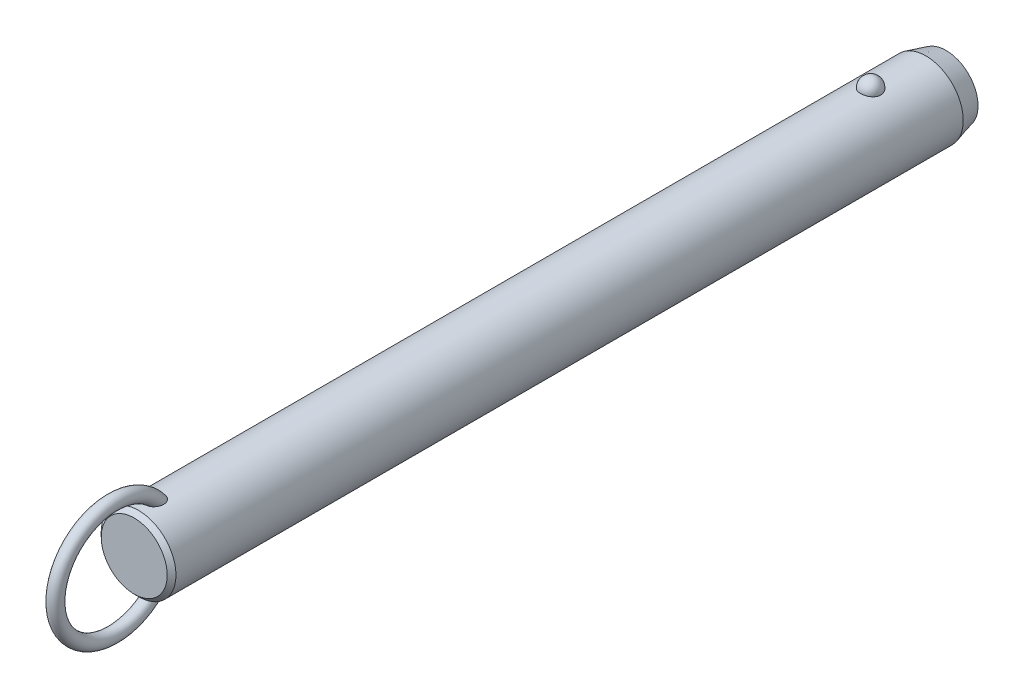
ISO-10303-21;
HEADER;
FILE_DESCRIPTION(('STEP AP214'),'2;1');
FILE_NAME('part.step','',(''),(''),'','','');
FILE_SCHEMA(('AUTOMOTIVE_DESIGN { 1 0 10303 214 1 1 1 1 }'));
ENDSEC;
DATA;
#1=APPLICATION_CONTEXT('core data for automotive mechanical design processes');
#2=APPLICATION_PROTOCOL_DEFINITION('international standard','automotive_design',2000,#1);
#3=PRODUCT_CONTEXT('',#1,'mechanical');
#4=PRODUCT('Part','Part','',(#3));
#5=PRODUCT_RELATED_PRODUCT_CATEGORY('part','',(#4));
#6=PRODUCT_DEFINITION_FORMATION('','',#4);
#7=PRODUCT_DEFINITION_CONTEXT('part definition',#1,'design');
#8=PRODUCT_DEFINITION('design','',#6,#7);
#9=PRODUCT_DEFINITION_SHAPE('','',#8);
#10=(LENGTH_UNIT() NAMED_UNIT(*) SI_UNIT(.MILLI.,.METRE.));
#11=(NAMED_UNIT(*) PLANE_ANGLE_UNIT() SI_UNIT($,.RADIAN.));
#12=(NAMED_UNIT(*) SI_UNIT($,.STERADIAN.) SOLID_ANGLE_UNIT());
#13=UNCERTAINTY_MEASURE_WITH_UNIT(LENGTH_MEASURE(1.E-05),#10,'distance_accuracy_value','');
#14=(GEOMETRIC_REPRESENTATION_CONTEXT(3) GLOBAL_UNCERTAINTY_ASSIGNED_CONTEXT((#13)) GLOBAL_UNIT_ASSIGNED_CONTEXT((#10,
#11,#12)) REPRESENTATION_CONTEXT('',''));
#15=CARTESIAN_POINT('',(0.,0.,0.));
#16=DIRECTION('',(0.,0.,1.));
#17=DIRECTION('',(1.,0.,0.));
#18=AXIS2_PLACEMENT_3D('',#15,#16,#17);
#19=CARTESIAN_POINT('',(0.,0.,203.));
#20=DIRECTION('',(0.,0.,-1.));
#21=DIRECTION('',(-1.,0.,0.));
#22=AXIS2_PLACEMENT_3D('',#19,#20,#21);
#23=CYLINDRICAL_SURFACE('',#22,11.1);
#24=CARTESIAN_POINT('',(2.9724815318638,10.6945945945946,-3.00000000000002));
#25=CARTESIAN_POINT('',(2.9724783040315,10.6945972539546,-2.8322505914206));
#26=CARTESIAN_POINT('',(2.95876598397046,10.6984356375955,-2.66445972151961));
#27=CARTESIAN_POINT('',(2.90424529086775,10.7133624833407,-2.3336238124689));
#28=CARTESIAN_POINT('',(2.8634252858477,10.7244540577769,-2.17058084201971));
#29=CARTESIAN_POINT('',(2.75573657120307,10.7526272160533,-1.85396767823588));
#30=CARTESIAN_POINT('',(2.68887937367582,10.7697061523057,-1.70039333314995));
#31=CARTESIAN_POINT('',(2.53079696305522,10.8079438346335,-1.40691598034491));
#32=CARTESIAN_POINT('',(2.43957264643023,10.8291024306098,-1.26701246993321));
#33=CARTESIAN_POINT('',(2.23458150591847,10.8732541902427,-1.00409565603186));
#34=CARTESIAN_POINT('',(2.12071295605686,10.8962553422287,-0.881162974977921));
#35=CARTESIAN_POINT('',(1.87365402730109,10.9414421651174,-0.656352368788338));
#36=CARTESIAN_POINT('',(1.74046358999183,10.9636278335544,-0.554474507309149));
#37=CARTESIAN_POINT('',(1.45872188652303,11.0046495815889,-0.374872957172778));
#38=CARTESIAN_POINT('',(1.31021276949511,11.0234944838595,-0.297085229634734));
#39=CARTESIAN_POINT('',(1.00170030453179,11.0557957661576,-0.167529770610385));
#40=CARTESIAN_POINT('',(0.841698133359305,11.0692526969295,-0.115759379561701));
#41=CARTESIAN_POINT('',(0.51760779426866,11.0890932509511,-0.040392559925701));
#42=CARTESIAN_POINT('',(0.353633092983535,11.0955916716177,-0.0163383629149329));
#43=CARTESIAN_POINT('',(0.0238420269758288,11.1011989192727,0.00445177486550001));
#44=CARTESIAN_POINT('',(-0.141974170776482,11.1003084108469,0.00119017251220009));
#45=CARTESIAN_POINT('',(-0.468405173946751,11.0912990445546,-0.0323233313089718));
#46=CARTESIAN_POINT('',(-0.629059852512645,11.0832767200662,-0.0622147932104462));
#47=CARTESIAN_POINT('',(-0.942937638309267,11.0609962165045,-0.147645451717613));
#48=CARTESIAN_POINT('',(-1.09616062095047,11.0467379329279,-0.20318507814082));
#49=CARTESIAN_POINT('',(-1.39181061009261,11.0134071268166,-0.338752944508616));
#50=CARTESIAN_POINT('',(-1.53417383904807,10.9943086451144,-0.418913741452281));
#51=CARTESIAN_POINT('',(-1.80342160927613,10.9533667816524,-0.601448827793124));
#52=CARTESIAN_POINT('',(-1.9303046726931,10.9315231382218,-0.703825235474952));
#53=CARTESIAN_POINT('',(-2.16747598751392,10.887005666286,-0.930091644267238));
#54=CARTESIAN_POINT('',(-2.27742774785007,10.8643239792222,-1.05433291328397));
#55=CARTESIAN_POINT('',(-2.47517316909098,10.8209886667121,-1.31966633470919));
#56=CARTESIAN_POINT('',(-2.56296538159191,10.8003351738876,-1.46075958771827));
#57=CARTESIAN_POINT('',(-2.71500300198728,10.7631304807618,-1.75753646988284));
#58=CARTESIAN_POINT('',(-2.77898901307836,10.7466250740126,-1.91335887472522));
#59=CARTESIAN_POINT('',(-2.88046189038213,10.7198747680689,-2.23391529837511));
#60=CARTESIAN_POINT('',(-2.91794947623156,10.709629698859,-2.3986490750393));
#61=CARTESIAN_POINT('',(-2.96537819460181,10.6965949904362,-2.73165170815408));
#62=CARTESIAN_POINT('',(-2.97542891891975,10.693775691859,-2.89990378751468));
#63=CARTESIAN_POINT('',(-2.96804271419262,10.6958279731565,-3.23575286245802));
#64=CARTESIAN_POINT('',(-2.95060646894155,10.7006993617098,-3.4033498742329));
#65=CARTESIAN_POINT('',(-2.88883358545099,10.71753912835,-3.73233906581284));
#66=CARTESIAN_POINT('',(-2.84462026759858,10.7294749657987,-3.89375610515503));
#67=CARTESIAN_POINT('',(-2.73050447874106,10.7590797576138,-4.20667949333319));
#68=CARTESIAN_POINT('',(-2.66060103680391,10.7767489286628,-4.35818546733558));
#69=CARTESIAN_POINT('',(-2.49642559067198,10.8159599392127,-4.64785421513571));
#70=CARTESIAN_POINT('',(-2.40203047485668,10.8375211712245,-4.78594458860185));
#71=CARTESIAN_POINT('',(-2.19143488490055,10.8820570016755,-5.04410382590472));
#72=CARTESIAN_POINT('',(-2.07523364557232,10.9050316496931,-5.16417205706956));
#73=CARTESIAN_POINT('',(-1.82361254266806,10.9499219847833,-5.38334833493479));
#74=CARTESIAN_POINT('',(-1.68812945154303,10.9718338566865,-5.48238464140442));
#75=CARTESIAN_POINT('',(-1.40191298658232,11.0120611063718,-5.6561887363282));
#76=CARTESIAN_POINT('',(-1.25118062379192,11.0303767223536,-5.73095813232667));
#77=CARTESIAN_POINT('',(-0.940570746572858,11.0611653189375,-5.85334725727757));
#78=CARTESIAN_POINT('',(-0.780821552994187,11.0737044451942,-5.90127578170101));
#79=CARTESIAN_POINT('',(-0.455204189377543,11.0918598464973,-5.9699297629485));
#80=CARTESIAN_POINT('',(-0.289336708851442,11.0974768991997,-5.99065827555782));
#81=CARTESIAN_POINT('',(0.0406846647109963,11.1011307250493,-6.00418773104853));
#82=CARTESIAN_POINT('',(0.204817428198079,11.099299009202,-5.99747318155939));
#83=CARTESIAN_POINT('',(0.529553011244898,11.088551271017,-5.95740317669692));
#84=CARTESIAN_POINT('',(0.690155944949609,11.0796354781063,-5.92404858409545));
#85=CARTESIAN_POINT('',(1.0027760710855,11.0557204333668,-5.83180084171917));
#86=CARTESIAN_POINT('',(1.15482001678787,11.0407414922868,-5.7729929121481));
#87=CARTESIAN_POINT('',(1.44678373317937,11.0062913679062,-5.63147366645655));
#88=CARTESIAN_POINT('',(1.58670279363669,10.9868199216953,-5.54876095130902));
#89=CARTESIAN_POINT('',(1.8527023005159,10.9451315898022,-5.36027644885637));
#90=CARTESIAN_POINT('',(1.97855158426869,10.9228788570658,-5.25418644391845));
#91=CARTESIAN_POINT('',(2.21080872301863,10.8782509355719,-5.02251354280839));
#92=CARTESIAN_POINT('',(2.31721312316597,10.8558757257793,-4.89692718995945));
#93=CARTESIAN_POINT('',(2.5094551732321,10.8130715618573,-4.62745408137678));
#94=CARTESIAN_POINT('',(2.59493284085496,10.7926798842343,-4.48330448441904));
#95=CARTESIAN_POINT('',(2.740862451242,10.7565495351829,-4.18236358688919));
#96=CARTESIAN_POINT('',(2.80132490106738,10.7408089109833,-4.02557762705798));
#97=CARTESIAN_POINT('',(2.88959070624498,10.7173718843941,-3.72475308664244));
#98=CARTESIAN_POINT('',(2.92062102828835,10.7088950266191,-3.58171216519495));
#99=CARTESIAN_POINT('',(2.96206765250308,10.6975052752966,-3.29245795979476));
#100=CARTESIAN_POINT('',(2.97248434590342,10.6945922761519,-3.14624473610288));
#101=CARTESIAN_POINT('',(2.9724815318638,10.6945945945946,-3.00000000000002));
#102=B_SPLINE_CURVE_WITH_KNOTS('',3,(#24,#25,#26,#27,#28,#29,#30,#31,#32,#33,#34,#35,#36,#37,
#38,#39,#40,#41,#42,#43,#44,#45,#46,#47,#48,#49,#50,#51,#52,#53,#54,#55,#56,#57,#58,#59,#60,#61,
#62,#63,#64,#65,#66,#67,#68,#69,#70,#71,#72,#73,#74,#75,#76,#77,#78,#79,#80,#81,#82,#83,#84,#85,
#86,#87,#88,#89,#90,#91,#92,#93,#94,#95,#96,#97,#98,#99,#100,#101),.UNSPECIFIED.,.T.,.F.,(4,2,2,
2,2,2,2,2,2,2,2,2,2,2,2,2,2,2,2,2,2,2,2,2,2,2,2,2,2,2,2,2,2,2,2,2,2,2,4),(0.,0.502722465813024,
1.00566079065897,1.5083769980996,2.01107471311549,2.51608392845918,3.02109467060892,
3.52475118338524,4.02835620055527,4.523518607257,5.0186364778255,5.50715297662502,
5.99567766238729,6.48688002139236,6.97812923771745,7.47814366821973,7.97819077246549,
8.48353712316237,8.98886974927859,9.49218093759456,9.99547960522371,10.4964777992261,
10.997494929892,11.5010810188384,12.0046847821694,12.5099796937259,13.0152411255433,
13.5145635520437,14.0138298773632,14.5043200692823,14.9947943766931,15.4836390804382,
15.9725123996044,16.4685040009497,16.9645836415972,17.4686765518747,17.972557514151,
18.410841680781,18.849117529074),.UNSPECIFIED.);
#103=CARTESIAN_POINT('',(2.9724815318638,10.6945945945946,-3.00000000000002));
#104=VERTEX_POINT('',#103);
#105=EDGE_CURVE('E41',#104,#104,#102,.T.);
#106=ORIENTED_EDGE('',*,*,#105,.T.);
#107=EDGE_LOOP('',(#106));
#108=FACE_BOUND('',#107,.T.);
#109=CARTESIAN_POINT('',(0.,0.,214.4));
#110=DIRECTION('',(0.,0.,1.));
#111=DIRECTION('',(1.,0.,0.));
#112=AXIS2_PLACEMENT_3D('',#109,#110,#111);
#113=CIRCLE('',#112,11.1);
#114=CARTESIAN_POINT('',(11.1,0.,214.4));
#115=VERTEX_POINT('',#114);
#116=EDGE_CURVE('E10',#115,#115,#113,.F.);
#117=ORIENTED_EDGE('',*,*,#116,.T.);
#118=EDGE_LOOP('',(#117));
#119=FACE_BOUND('',#118,.T.);
#120=CARTESIAN_POINT('',(-0.564520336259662,-11.0856356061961,206.657815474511));
#121=CARTESIAN_POINT('',(-0.667202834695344,-11.0804062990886,206.691283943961));
#122=CARTESIAN_POINT('',(-0.766875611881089,-11.0738877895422,206.733835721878));
#123=CARTESIAN_POINT('',(-0.957284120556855,-11.0590576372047,206.835419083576));
#124=CARTESIAN_POINT('',(-1.04801616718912,-11.0507452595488,206.89445742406));
#125=CARTESIAN_POINT('',(-1.21800952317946,-11.0333016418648,207.026529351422));
#126=CARTESIAN_POINT('',(-1.29730805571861,-11.0241732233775,207.099515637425));
#127=CARTESIAN_POINT('',(-1.44337665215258,-11.0060026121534,207.257037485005));
#128=CARTESIAN_POINT('',(-1.51014622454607,-10.9969604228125,207.341573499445));
#129=CARTESIAN_POINT('',(-1.63454620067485,-10.9791841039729,207.525521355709));
#130=CARTESIAN_POINT('',(-1.69127003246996,-10.9705107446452,207.625549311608));
#131=CARTESIAN_POINT('',(-1.78980785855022,-10.9548648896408,207.832790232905));
#132=CARTESIAN_POINT('',(-1.83161214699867,-10.9478935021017,207.940007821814));
#133=CARTESIAN_POINT('',(-1.91557028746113,-10.9335803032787,208.205408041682));
#134=CARTESIAN_POINT('',(-1.95040620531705,-10.9273269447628,208.365980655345));
#135=CARTESIAN_POINT('',(-1.99388326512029,-10.9194709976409,208.690697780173));
#136=CARTESIAN_POINT('',(-2.00248051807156,-10.9178762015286,208.854847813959));
#137=CARTESIAN_POINT('',(-1.99551615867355,-10.9191578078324,209.224650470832));
#138=CARTESIAN_POINT('',(-1.97322066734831,-10.9232807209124,209.430191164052));
#139=CARTESIAN_POINT('',(-1.91529761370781,-10.9335244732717,209.733595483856));
#140=CARTESIAN_POINT('',(-1.8918457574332,-10.9376266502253,209.834088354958));
#141=CARTESIAN_POINT('',(-1.83700674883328,-10.9469720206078,210.032855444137));
#142=CARTESIAN_POINT('',(-1.80562070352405,-10.9522150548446,210.131129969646));
#143=CARTESIAN_POINT('',(-1.73463055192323,-10.9636837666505,210.325914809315));
#144=CARTESIAN_POINT('',(-1.69493416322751,-10.9699202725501,210.422390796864));
#145=CARTESIAN_POINT('',(-1.6074514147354,-10.9830806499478,210.611626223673));
#146=CARTESIAN_POINT('',(-1.55966150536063,-10.9900048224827,210.704384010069));
#147=CARTESIAN_POINT('',(-1.45591812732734,-11.0042280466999,210.884690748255));
#148=CARTESIAN_POINT('',(-1.40000013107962,-11.0115253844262,210.972260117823));
#149=CARTESIAN_POINT('',(-1.27937470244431,-11.0261911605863,211.141029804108));
#150=CARTESIAN_POINT('',(-1.21467835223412,-11.0335594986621,211.22223795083));
#151=CARTESIAN_POINT('',(-1.08218150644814,-11.0473027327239,211.369001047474));
#152=CARTESIAN_POINT('',(-1.01522633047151,-11.0537063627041,211.435309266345));
#153=CARTESIAN_POINT('',(-0.872952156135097,-11.065850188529,211.558378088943));
#154=CARTESIAN_POINT('',(-0.797642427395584,-11.0715911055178,211.615149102));
#155=CARTESIAN_POINT('',(-0.65139686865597,-11.081071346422,211.707515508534));
#156=CARTESIAN_POINT('',(-0.581712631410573,-11.0849841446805,211.745049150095));
#157=CARTESIAN_POINT('',(-0.437066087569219,-11.0916271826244,211.808259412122));
#158=CARTESIAN_POINT('',(-0.362109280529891,-11.0943586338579,211.833948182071));
#159=CARTESIAN_POINT('',(-0.207828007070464,-11.0983242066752,211.871117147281));
#160=CARTESIAN_POINT('',(-0.128467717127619,-11.0995432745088,211.882454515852));
#161=CARTESIAN_POINT('',(0.0309101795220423,-11.1002423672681,211.888965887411));
#162=CARTESIAN_POINT('',(0.110927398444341,-11.0997233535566,211.884148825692));
#163=CARTESIAN_POINT('',(0.256406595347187,-11.097240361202,211.860959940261));
#164=CARTESIAN_POINT('',(0.322235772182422,-11.0955074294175,211.844754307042));
#165=CARTESIAN_POINT('',(0.450635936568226,-11.0910350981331,211.802600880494));
#166=CARTESIAN_POINT('',(0.513205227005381,-11.0882951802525,211.776648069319));
#167=CARTESIAN_POINT('',(0.662626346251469,-11.0805620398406,211.702607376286));
#168=CARTESIAN_POINT('',(0.747127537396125,-11.0751144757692,211.649845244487));
#169=CARTESIAN_POINT('',(0.906756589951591,-11.0631932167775,211.531720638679));
#170=CARTESIAN_POINT('',(0.981859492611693,-11.0567168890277,211.466325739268));
#171=CARTESIAN_POINT('',(1.10712207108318,-11.0447856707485,211.34226337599));
#172=CARTESIAN_POINT('',(1.15909566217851,-11.0394280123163,211.285383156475));
#173=CARTESIAN_POINT('',(1.25791923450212,-11.0286040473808,211.167327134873));
#174=CARTESIAN_POINT('',(1.3047664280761,-11.0231376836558,211.106149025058));
#175=CARTESIAN_POINT('',(1.43818612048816,-11.0068027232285,210.917305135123));
#176=CARTESIAN_POINT('',(1.5175176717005,-10.9960104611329,210.784453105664));
#177=CARTESIAN_POINT('',(1.63597546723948,-10.9788847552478,210.553137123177));
#178=CARTESIAN_POINT('',(1.67988876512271,-10.9722190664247,210.457053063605));
#179=CARTESIAN_POINT('',(1.75953241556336,-10.9597298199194,210.261431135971));
#180=CARTESIAN_POINT('',(1.79525967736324,-10.9539065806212,210.161891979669));
#181=CARTESIAN_POINT('',(1.85844731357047,-10.9433632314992,209.96021118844));
#182=CARTESIAN_POINT('',(1.88591073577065,-10.9386427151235,209.858070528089));
#183=CARTESIAN_POINT('',(1.93234324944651,-10.9305350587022,209.651819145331));
#184=CARTESIAN_POINT('',(1.95131065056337,-10.9271481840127,209.547708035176));
#185=CARTESIAN_POINT('',(1.99040203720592,-10.9201183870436,209.265458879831));
#186=CARTESIAN_POINT('',(2.00221217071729,-10.9179256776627,209.086037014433));
#187=CARTESIAN_POINT('',(1.99711676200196,-10.9188636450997,208.727713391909));
#188=CARTESIAN_POINT('',(1.98026150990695,-10.9219849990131,208.548811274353));
#189=CARTESIAN_POINT('',(1.92151657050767,-10.9324473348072,208.23645144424));
#190=CARTESIAN_POINT('',(1.88605081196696,-10.9386915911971,208.101759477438));
#191=CARTESIAN_POINT('',(1.7939302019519,-10.9541780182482,207.839966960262));
#192=CARTESIAN_POINT('',(1.73729868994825,-10.9634168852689,207.712858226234));
#193=CARTESIAN_POINT('',(1.61237037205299,-10.9824218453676,207.489418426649));
#194=CARTESIAN_POINT('',(1.54715374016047,-10.9918945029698,207.391345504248));
#195=CARTESIAN_POINT('',(1.40127026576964,-11.0114415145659,207.207434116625));
#196=CARTESIAN_POINT('',(1.32060742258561,-11.0215157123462,207.121592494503));
#197=CARTESIAN_POINT('',(1.14474787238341,-11.041168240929,206.965163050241));
#198=CARTESIAN_POINT('',(1.04947805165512,-11.0507437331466,206.894656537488));
#199=CARTESIAN_POINT('',(0.847278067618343,-11.0680789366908,206.772640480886));
#200=CARTESIAN_POINT('',(0.740351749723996,-11.0758392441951,206.721124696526));
#201=CARTESIAN_POINT('',(0.529289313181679,-11.0878275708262,206.643485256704));
#202=CARTESIAN_POINT('',(0.425895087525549,-11.0923259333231,206.615377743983));
#203=CARTESIAN_POINT('',(0.215723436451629,-11.0984001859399,206.577703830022));
#204=CARTESIAN_POINT('',(0.108947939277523,-11.0999777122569,206.568127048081));
#205=CARTESIAN_POINT('',(-0.0938962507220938,-11.1000196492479,206.567877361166));
#206=CARTESIAN_POINT('',(-0.189967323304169,-11.0987797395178,206.575408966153));
#207=CARTESIAN_POINT('',(-0.379657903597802,-11.0939111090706,206.605507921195));
#208=CARTESIAN_POINT('',(-0.473277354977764,-11.0902823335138,206.628075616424));
#209=CARTESIAN_POINT('',(-0.564520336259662,-11.0856356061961,206.657815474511));
#210=B_SPLINE_CURVE_WITH_KNOTS('',3,(#120,#121,#122,#123,#124,#125,#126,#127,#128,#129,#130,
#131,#132,#133,#134,#135,#136,#137,#138,#139,#140,#141,#142,#143,#144,#145,#146,#147,#148,#149,
#150,#151,#152,#153,#154,#155,#156,#157,#158,#159,#160,#161,#162,#163,#164,#165,#166,#167,#168,
#169,#170,#171,#172,#173,#174,#175,#176,#177,#178,#179,#180,#181,#182,#183,#184,#185,#186,#187,
#188,#189,#190,#191,#192,#193,#194,#195,#196,#197,#198,#199,#200,#201,#202,#203,#204,#205,#206,
#207,#208,#209),.UNSPECIFIED.,.T.,.F.,(4,2,2,2,2,2,2,2,2,2,2,2,2,2,2,2,2,2,2,2,2,2,2,2,2,2,2,2,
2,2,2,2,2,2,2,2,2,2,2,2,2,2,2,2,4),(0.,0.323999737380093,0.648132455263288,0.971184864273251,
1.29424994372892,1.63886237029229,1.98369857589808,2.47426059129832,2.96564271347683,
3.58257396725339,3.89215258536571,4.201688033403,4.5148627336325,4.82817514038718,
5.14015911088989,5.45175282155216,5.73442856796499,6.01679375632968,6.25364580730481,
6.49025437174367,6.72919963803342,6.96801276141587,7.17061258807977,7.37331685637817,
7.67094989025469,7.96935728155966,8.20075067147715,8.43226927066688,8.89581623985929,
9.2130653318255,9.53043400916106,9.84768549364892,10.1650000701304,10.70229304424,
11.2386443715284,11.6553390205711,12.0715755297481,12.4245637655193,12.7774607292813,
13.1321855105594,13.4867936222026,13.8068771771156,14.1267813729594,14.4146787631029,
14.7025827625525),.UNSPECIFIED.);
#211=CARTESIAN_POINT('',(-0.564520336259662,-11.0856356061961,206.657815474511));
#212=VERTEX_POINT('',#211);
#213=EDGE_CURVE('E59',#212,#212,#210,.T.);
#214=ORIENTED_EDGE('',*,*,#213,.T.);
#215=EDGE_LOOP('',(#214));
#216=FACE_BOUND('',#215,.T.);
#217=CARTESIAN_POINT('',(-0.564520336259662,11.0856356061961,206.657815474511));
#218=CARTESIAN_POINT('',(-0.46854206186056,11.0905203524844,206.626545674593));
#219=CARTESIAN_POINT('',(-0.369793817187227,11.0942886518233,206.603157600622));
#220=CARTESIAN_POINT('',(-0.169555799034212,11.0991586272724,206.573085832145));
#221=CARTESIAN_POINT('',(-0.0680604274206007,11.1002543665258,206.56643932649));
#222=CARTESIAN_POINT('',(0.134549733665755,11.099646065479,206.570157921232));
#223=CARTESIAN_POINT('',(0.235664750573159,11.0979441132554,206.58051033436));
#224=CARTESIAN_POINT('',(0.434632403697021,11.0919342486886,206.617831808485));
#225=CARTESIAN_POINT('',(0.53248665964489,11.0876276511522,206.644792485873));
#226=CARTESIAN_POINT('',(0.722445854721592,11.0768742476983,206.7144096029));
#227=CARTESIAN_POINT('',(0.814543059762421,11.0704246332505,206.757086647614));
#228=CARTESIAN_POINT('',(0.990565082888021,11.0560659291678,206.856648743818));
#229=CARTESIAN_POINT('',(1.07448844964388,11.048156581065,206.913536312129));
#230=CARTESIAN_POINT('',(1.23562672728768,11.0313221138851,207.042210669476));
#231=CARTESIAN_POINT('',(1.31242684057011,11.0223686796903,207.114511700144));
#232=CARTESIAN_POINT('',(1.45398030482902,11.0045918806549,207.270042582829));
#233=CARTESIAN_POINT('',(1.51873073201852,10.9957685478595,207.353275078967));
#234=CARTESIAN_POINT('',(1.64107232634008,10.9782087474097,207.536384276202));
#235=CARTESIAN_POINT('',(1.6974317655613,10.9695572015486,207.637089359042));
#236=CARTESIAN_POINT('',(1.79515063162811,10.9539887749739,207.845626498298));
#237=CARTESIAN_POINT('',(1.83649966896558,10.9470730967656,207.95346343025));
#238=CARTESIAN_POINT('',(1.91931148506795,10.9329211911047,208.220399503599));
#239=CARTESIAN_POINT('',(1.95340104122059,10.9267904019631,208.381861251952));
#240=CARTESIAN_POINT('',(1.99526195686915,10.9192174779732,208.70821631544));
#241=CARTESIAN_POINT('',(2.00298989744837,10.9177830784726,208.87311484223));
#242=CARTESIAN_POINT('',(1.99396251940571,10.9194420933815,209.244100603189));
#243=CARTESIAN_POINT('',(1.97050829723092,10.923774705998,209.45003871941));
#244=CARTESIAN_POINT('',(1.91079643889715,10.9343131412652,209.753901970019));
#245=CARTESIAN_POINT('',(1.88673702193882,10.9385106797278,209.854529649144));
#246=CARTESIAN_POINT('',(1.8306550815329,10.9480376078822,210.053510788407));
#247=CARTESIAN_POINT('',(1.79863369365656,10.9533668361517,210.151864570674));
#248=CARTESIAN_POINT('',(1.72633365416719,10.9649954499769,210.346720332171));
#249=CARTESIAN_POINT('',(1.68596409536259,10.9713053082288,210.44318790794));
#250=CARTESIAN_POINT('',(1.59707998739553,10.9845964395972,210.632323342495));
#251=CARTESIAN_POINT('',(1.54856169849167,10.9915780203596,210.724989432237));
#252=CARTESIAN_POINT('',(1.44330168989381,11.0058935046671,210.904975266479));
#253=CARTESIAN_POINT('',(1.3865974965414,11.0132257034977,210.992316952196));
#254=CARTESIAN_POINT('',(1.2643115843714,11.0279330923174,211.160456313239));
#255=CARTESIAN_POINT('',(1.19874160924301,11.0353082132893,211.241262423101));
#256=CARTESIAN_POINT('',(1.06542088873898,11.048931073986,211.385985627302));
#257=CARTESIAN_POINT('',(0.998640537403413,11.0552153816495,211.450784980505));
#258=CARTESIAN_POINT('',(0.856896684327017,11.0671032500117,211.570846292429));
#259=CARTESIAN_POINT('',(0.781942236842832,11.0727075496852,211.626118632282));
#260=CARTESIAN_POINT('',(0.636276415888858,11.081949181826,211.715972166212));
#261=CARTESIAN_POINT('',(0.566755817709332,11.0857572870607,211.752441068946));
#262=CARTESIAN_POINT('',(0.422602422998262,11.0921860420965,211.813533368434));
#263=CARTESIAN_POINT('',(0.347974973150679,11.0948079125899,211.838168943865));
#264=CARTESIAN_POINT('',(0.194593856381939,11.0985608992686,211.873323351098));
#265=CARTESIAN_POINT('',(0.115807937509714,11.0996777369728,211.883706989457));
#266=CARTESIAN_POINT('',(-0.042249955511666,11.1002003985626,211.888574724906));
#267=CARTESIAN_POINT('',(-0.121521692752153,11.09960699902,211.883066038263));
#268=CARTESIAN_POINT('',(-0.266046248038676,11.0970123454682,211.858827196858));
#269=CARTESIAN_POINT('',(-0.331661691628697,11.0952283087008,211.842135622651));
#270=CARTESIAN_POINT('',(-0.459588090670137,11.0906663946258,211.799111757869));
#271=CARTESIAN_POINT('',(-0.521897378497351,11.0878880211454,211.772774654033));
#272=CARTESIAN_POINT('',(-0.671446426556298,11.0800342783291,211.697513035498));
#273=CARTESIAN_POINT('',(-0.756250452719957,11.0744969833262,211.643818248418));
#274=CARTESIAN_POINT('',(-0.91634957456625,11.0624045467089,211.523802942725));
#275=CARTESIAN_POINT('',(-0.991618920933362,11.0558467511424,211.457449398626));
#276=CARTESIAN_POINT('',(-1.11713140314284,11.0437783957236,211.331633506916));
#277=CARTESIAN_POINT('',(-1.16920539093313,11.0383619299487,211.273952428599));
#278=CARTESIAN_POINT('',(-1.26817476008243,11.02743010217,211.154280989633));
#279=CARTESIAN_POINT('',(-1.315067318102,11.0219146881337,211.092288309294));
#280=CARTESIAN_POINT('',(-1.40399813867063,11.0109399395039,210.964784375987));
#281=CARTESIAN_POINT('',(-1.44602864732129,11.0054807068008,210.899267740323));
#282=CARTESIAN_POINT('',(-1.52538779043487,10.9947621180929,210.765422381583));
#283=CARTESIAN_POINT('',(-1.56271516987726,10.9895028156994,210.697092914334));
#284=CARTESIAN_POINT('',(-1.64537943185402,10.9774790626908,210.533210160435));
#285=CARTESIAN_POINT('',(-1.68879497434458,10.9708503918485,210.4366735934));
#286=CARTESIAN_POINT('',(-1.76740738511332,10.9584602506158,210.240236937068));
#287=CARTESIAN_POINT('',(-1.80260120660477,10.95269910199,210.14033561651));
#288=CARTESIAN_POINT('',(-1.86468657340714,10.9423003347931,209.937966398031));
#289=CARTESIAN_POINT('',(-1.89158164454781,10.9376622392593,209.835499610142));
#290=CARTESIAN_POINT('',(-1.93682458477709,10.9297405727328,209.628642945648));
#291=CARTESIAN_POINT('',(-1.95517082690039,10.9264572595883,209.524252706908));
#292=CARTESIAN_POINT('',(-1.99232562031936,10.9197647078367,209.24262876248));
#293=CARTESIAN_POINT('',(-2.00294603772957,10.9177914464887,209.064185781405));
#294=CARTESIAN_POINT('',(-1.99566675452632,10.9191290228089,208.707996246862));
#295=CARTESIAN_POINT('',(-1.97781651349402,10.9224306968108,208.53024902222));
#296=CARTESIAN_POINT('',(-1.91747214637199,10.9331592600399,208.219792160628));
#297=CARTESIAN_POINT('',(-1.88131022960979,10.9395108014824,208.085825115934));
#298=CARTESIAN_POINT('',(-1.78790380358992,10.9551659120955,207.82559757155));
#299=CARTESIAN_POINT('',(-1.73068309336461,10.9644661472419,207.699328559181));
#300=CARTESIAN_POINT('',(-1.60475573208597,10.9835398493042,207.47741565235));
#301=CARTESIAN_POINT('',(-1.53908879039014,10.9930297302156,207.380026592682));
#302=CARTESIAN_POINT('',(-1.39238608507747,11.0125708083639,207.197525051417));
#303=CARTESIAN_POINT('',(-1.31135150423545,11.0226219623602,207.112411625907));
#304=CARTESIAN_POINT('',(-1.14382035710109,11.0411991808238,206.96529943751));
#305=CARTESIAN_POINT('',(-1.0585850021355,11.0497792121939,206.90186930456));
#306=CARTESIAN_POINT('',(-0.878723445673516,11.0655285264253,206.790250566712));
#307=CARTESIAN_POINT('',(-0.784123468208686,11.0727015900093,206.742020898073));
#308=CARTESIAN_POINT('',(-0.646163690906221,11.0812501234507,206.686023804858));
#309=CARTESIAN_POINT('',(-0.605595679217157,11.0835451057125,206.671197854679));
#310=CARTESIAN_POINT('',(-0.564520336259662,11.0856356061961,206.657815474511));
#311=B_SPLINE_CURVE_WITH_KNOTS('',3,(#217,#218,#219,#220,#221,#222,#223,#224,#225,#226,#227,
#228,#229,#230,#231,#232,#233,#234,#235,#236,#237,#238,#239,#240,#241,#242,#243,#244,#245,#246,
#247,#248,#249,#250,#251,#252,#253,#254,#255,#256,#257,#258,#259,#260,#261,#262,#263,#264,#265,
#266,#267,#268,#269,#270,#271,#272,#273,#274,#275,#276,#277,#278,#279,#280,#281,#282,#283,#284,
#285,#286,#287,#288,#289,#290,#291,#292,#293,#294,#295,#296,#297,#298,#299,#300,#301,#302,#303,
#304,#305,#306,#307,#308,#309,#310),.UNSPECIFIED.,.T.,.F.,(4,2,2,2,2,2,2,2,2,2,2,2,2,2,2,2,2,2,
2,2,2,2,2,2,2,2,2,2,2,2,2,2,2,2,2,2,2,2,2,2,2,2,2,2,2,2,4),(0.,0.303061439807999,
0.606795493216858,0.910302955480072,1.21365733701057,1.51741085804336,1.82121821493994,
2.13745205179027,2.45376252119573,2.799586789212,3.14564996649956,3.63832391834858,
4.13180893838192,4.75031912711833,5.06071926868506,5.37107516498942,5.6850077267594,
5.99908475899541,6.31176519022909,6.62403542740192,6.90315673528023,7.18197194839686,
7.41687778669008,7.65154134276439,7.88841587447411,8.12518286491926,8.32752842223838,
8.52997509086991,8.82986421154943,9.13054668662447,9.36393502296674,9.59744991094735,
9.83133221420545,10.0652767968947,10.383032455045,10.7009056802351,11.0186436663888,
11.3364420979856,11.8705925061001,12.4038159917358,12.8189662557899,13.2336487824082,
13.5857049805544,13.9377340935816,14.2561354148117,14.5736690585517,14.7033687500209),.UNSPECIFIED.);
#312=CARTESIAN_POINT('',(-0.564520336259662,11.0856356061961,206.657815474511));
#313=VERTEX_POINT('',#312);
#314=EDGE_CURVE('E67',#313,#313,#311,.T.);
#315=ORIENTED_EDGE('',*,*,#314,.T.);
#316=EDGE_LOOP('',(#315));
#317=FACE_BOUND('',#316,.T.);
#318=CARTESIAN_POINT('',(0.,0.,-19.4000000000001));
#319=DIRECTION('',(0.,0.,-1.));
#320=DIRECTION('',(-1.,0.,0.));
#321=AXIS2_PLACEMENT_3D('',#318,#319,#320);
#322=CIRCLE('',#321,11.1);
#323=CARTESIAN_POINT('',(-11.1,0.,-19.4000000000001));
#324=VERTEX_POINT('',#323);
#325=EDGE_CURVE('E56',#324,#324,#322,.F.);
#326=ORIENTED_EDGE('',*,*,#325,.T.);
#327=EDGE_LOOP('',(#326));
#328=FACE_BOUND('',#327,.T.);
#329=ADVANCED_FACE('F37',(#108,#119,#216,#317,#328),#23,.T.);
#330=CARTESIAN_POINT('',(0.,0.,-25.4));
#331=DIRECTION('',(0.,0.,-1.));
#332=DIRECTION('',(-1.,0.,0.));
#333=AXIS2_PLACEMENT_3D('',#330,#331,#332);
#334=PLANE('',#333);
#335=CARTESIAN_POINT('',(0.,0.,-25.4));
#336=DIRECTION('',(0.,0.,-1.));
#337=DIRECTION('',(-1.,0.,0.));
#338=AXIS2_PLACEMENT_3D('',#335,#336,#337);
#339=CIRCLE('',#338,9.49230484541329);
#340=CARTESIAN_POINT('',(-9.49230484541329,0.,-25.4));
#341=VERTEX_POINT('',#340);
#342=EDGE_CURVE('E66',#341,#341,#339,.T.);
#343=ORIENTED_EDGE('',*,*,#342,.T.);
#344=EDGE_LOOP('',(#343));
#345=FACE_BOUND('',#344,.T.);
#346=ADVANCED_FACE('F85',(#345),#334,.T.);
#347=CARTESIAN_POINT('',(0.,0.,-25.4));
#348=DIRECTION('',(0.,0.,1.));
#349=DIRECTION('',(1.,0.,0.));
#350=AXIS2_PLACEMENT_3D('',#347,#348,#349);
#351=CONICAL_SURFACE('',#350,9.49230484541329,0.261799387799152);
#352=ORIENTED_EDGE('',*,*,#325,.F.);
#353=EDGE_LOOP('',(#352));
#354=FACE_BOUND('',#353,.T.);
#355=ORIENTED_EDGE('',*,*,#342,.F.);
#356=EDGE_LOOP('',(#355));
#357=FACE_BOUND('',#356,.T.);
#358=ADVANCED_FACE('F83',(#354,#357),#351,.T.);
#359=CARTESIAN_POINT('',(0.,0.,215.7));
#360=DIRECTION('',(0.,0.,1.));
#361=DIRECTION('',(1.,0.,0.));
#362=AXIS2_PLACEMENT_3D('',#359,#360,#361);
#363=PLANE('',#362);
#364=CARTESIAN_POINT('',(0.,0.,215.7));
#365=DIRECTION('',(0.,0.,1.));
#366=DIRECTION('',(1.,0.,0.));
#367=AXIS2_PLACEMENT_3D('',#364,#365,#366);
#368=CIRCLE('',#367,9.8000000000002);
#369=CARTESIAN_POINT('',(9.8000000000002,0.,215.7));
#370=VERTEX_POINT('',#369);
#371=EDGE_CURVE('E50',#370,#370,#368,.T.);
#372=ORIENTED_EDGE('',*,*,#371,.T.);
#373=EDGE_LOOP('',(#372));
#374=FACE_BOUND('',#373,.T.);
#375=ADVANCED_FACE('F77',(#374),#363,.T.);
#376=CARTESIAN_POINT('',(0.,0.,222.05));
#377=DIRECTION('',(1.,0.,0.));
#378=DIRECTION('',(0.,0.,-1.));
#379=AXIS2_PLACEMENT_3D('',#376,#377,#378);
#380=TOROIDAL_SURFACE('',#379,17.05,2.);
#381=ORIENTED_EDGE('',*,*,#314,.F.);
#382=EDGE_LOOP('',(#381));
#383=FACE_BOUND('',#382,.T.);
#384=ORIENTED_EDGE('',*,*,#213,.F.);
#385=EDGE_LOOP('',(#384));
#386=FACE_BOUND('',#385,.T.);
#387=ADVANCED_FACE('F73',(#383,#386),#380,.T.);
#388=CARTESIAN_POINT('',(0.,0.,215.7));
#389=DIRECTION('',(0.,0.,-1.));
#390=DIRECTION('',(-1.,0.,0.));
#391=AXIS2_PLACEMENT_3D('',#388,#389,#390);
#392=CONICAL_SURFACE('',#391,9.8000000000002,0.78539816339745);
#393=ORIENTED_EDGE('',*,*,#116,.F.);
#394=EDGE_LOOP('',(#393));
#395=FACE_BOUND('',#394,.T.);
#396=ORIENTED_EDGE('',*,*,#371,.F.);
#397=EDGE_LOOP('',(#396));
#398=FACE_BOUND('',#397,.T.);
#399=ADVANCED_FACE('F39',(#395,#398),#392,.T.);
#400=CARTESIAN_POINT('',(0.,11.1,-3.00000000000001));
#401=DIRECTION('',(0.,1.,0.));
#402=DIRECTION('',(0.,0.,-1.));
#403=AXIS2_PLACEMENT_3D('',#400,#401,#402);
#404=SPHERICAL_SURFACE('',#403,3.);
#405=ORIENTED_EDGE('',*,*,#105,.F.);
#406=EDGE_LOOP('',(#405));
#407=FACE_BOUND('',#406,.T.);
#408=ADVANCED_FACE('F79',(#407),#404,.T.);
#409=CLOSED_SHELL('',(#329,#346,#358,#375,#387,#399,#408));
#410=MANIFOLD_SOLID_BREP('B2',#409);
#411=ADVANCED_BREP_SHAPE_REPRESENTATION('',(#18,#410),#14);
#412=SHAPE_DEFINITION_REPRESENTATION(#9,#411);
ENDSEC;
END-ISO-10303-21;
